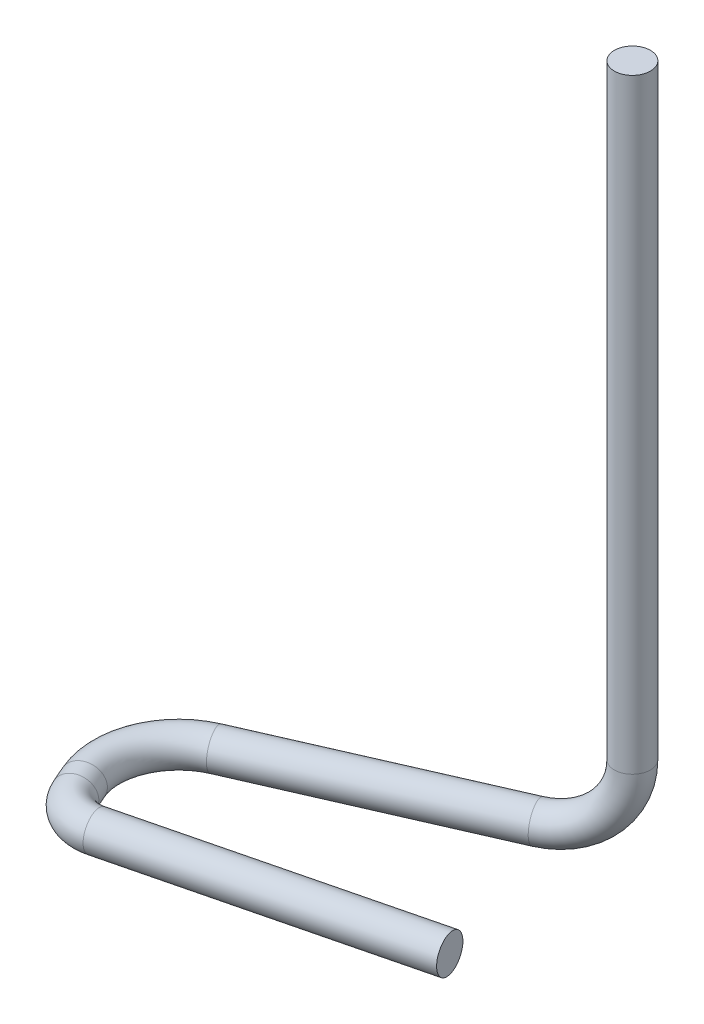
ISO-10303-21;
HEADER;
FILE_DESCRIPTION(('STEP AP214'),'2;1');
FILE_NAME('part.step','',(''),(''),'','','');
FILE_SCHEMA(('AUTOMOTIVE_DESIGN { 1 0 10303 214 1 1 1 1 }'));
ENDSEC;
DATA;
#1=APPLICATION_CONTEXT('core data for automotive mechanical design processes');
#2=APPLICATION_PROTOCOL_DEFINITION('international standard','automotive_design',2000,#1);
#3=PRODUCT_CONTEXT('',#1,'mechanical');
#4=PRODUCT('Part','Part','',(#3));
#5=PRODUCT_RELATED_PRODUCT_CATEGORY('part','',(#4));
#6=PRODUCT_DEFINITION_FORMATION('','',#4);
#7=PRODUCT_DEFINITION_CONTEXT('part definition',#1,'design');
#8=PRODUCT_DEFINITION('design','',#6,#7);
#9=PRODUCT_DEFINITION_SHAPE('','',#8);
#10=(LENGTH_UNIT() NAMED_UNIT(*) SI_UNIT(.MILLI.,.METRE.));
#11=(NAMED_UNIT(*) PLANE_ANGLE_UNIT() SI_UNIT($,.RADIAN.));
#12=(NAMED_UNIT(*) SI_UNIT($,.STERADIAN.) SOLID_ANGLE_UNIT());
#13=UNCERTAINTY_MEASURE_WITH_UNIT(LENGTH_MEASURE(1.E-05),#10,'distance_accuracy_value','');
#14=(GEOMETRIC_REPRESENTATION_CONTEXT(3) GLOBAL_UNCERTAINTY_ASSIGNED_CONTEXT((#13)) GLOBAL_UNIT_ASSIGNED_CONTEXT((#10,
#11,#12)) REPRESENTATION_CONTEXT('',''));
#15=CARTESIAN_POINT('',(0.,0.,0.));
#16=DIRECTION('',(0.,0.,1.));
#17=DIRECTION('',(1.,0.,0.));
#18=AXIS2_PLACEMENT_3D('',#15,#16,#17);
#19=CARTESIAN_POINT('',(0.66040203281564,-3.39999999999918,12.6905504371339));
#20=DIRECTION('',(0.970640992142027,0.,-0.240532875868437));
#21=DIRECTION('',(-0.240532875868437,0.,-0.970640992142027));
#22=AXIS2_PLACEMENT_3D('',#19,#20,#21);
#23=CYLINDRICAL_SURFACE('',#22,0.25);
#24=CARTESIAN_POINT('',(0.66040203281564,-3.39999999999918,12.6905504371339));
#25=DIRECTION('',(0.970640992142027,0.,-0.240532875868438));
#26=DIRECTION('',(0.22036018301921,-0.400873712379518,0.88923655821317));
#27=AXIS2_PLACEMENT_3D('',#24,#25,#26);
#28=CIRCLE('',#27,0.25);
#29=CARTESIAN_POINT('',(0.720535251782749,-3.39999999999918,12.9332106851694));
#30=VERTEX_POINT('',#29);
#31=EDGE_CURVE('E30',#30,#30,#28,.T.);
#32=ORIENTED_EDGE('',*,*,#31,.T.);
#33=EDGE_LOOP('',(#32));
#34=FACE_BOUND('',#33,.T.);
#35=CARTESIAN_POINT('',(4.59218813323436,-3.39999999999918,11.7162212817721));
#36=DIRECTION('',(0.970640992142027,0.,-0.240532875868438));
#37=DIRECTION('',(0.22036018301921,-0.400873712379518,0.88923655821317));
#38=AXIS2_PLACEMENT_3D('',#35,#36,#37);
#39=CIRCLE('',#38,0.25);
#40=CARTESIAN_POINT('',(4.64727817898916,-3.50021842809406,11.9385304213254));
#41=VERTEX_POINT('',#40);
#42=EDGE_CURVE('E10',#41,#41,#39,.T.);
#43=ORIENTED_EDGE('',*,*,#42,.F.);
#44=EDGE_LOOP('',(#43));
#45=FACE_BOUND('',#44,.T.);
#46=ADVANCED_FACE('F24',(#34,#45),#23,.T.);
#47=CARTESIAN_POINT('',(0.540135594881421,-3.39999999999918,12.2052299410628));
#48=DIRECTION('',(0.,1.,0.));
#49=DIRECTION('',(0.,0.,1.));
#50=AXIS2_PLACEMENT_3D('',#47,#48,#49);
#51=TOROIDAL_SURFACE('',#50,0.500000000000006,0.25);
#52=CARTESIAN_POINT('',(0.0820689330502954,-3.39999999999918,12.4056667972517));
#53=DIRECTION('',(0.400873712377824,0.,0.91613332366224));
#54=DIRECTION('',(-0.839300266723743,-0.400873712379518,0.367253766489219));
#55=AXIS2_PLACEMENT_3D('',#52,#53,#54);
#56=CIRCLE('',#55,0.25);
#57=CARTESIAN_POINT('',(-0.146964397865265,-3.39999999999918,12.5058852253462));
#58=VERTEX_POINT('',#57);
#59=EDGE_CURVE('E34',#58,#58,#56,.T.);
#60=CARTESIAN_POINT('',(0.540135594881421,-3.39999999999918,12.2052299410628));
#61=DIRECTION('',(0.,1.,0.));
#62=DIRECTION('',(0.,0.,1.));
#63=AXIS2_PLACEMENT_3D('',#60,#61,#62);
#64=CIRCLE('',#63,0.750000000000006);
#65=EDGE_CURVE('',#58,#30,#64,.T.);
#66=ORIENTED_EDGE('',*,*,#59,.T.);
#67=ORIENTED_EDGE('',*,*,#31,.F.);
#68=ORIENTED_EDGE('',*,*,#65,.T.);
#69=ORIENTED_EDGE('',*,*,#65,.F.);
#70=EDGE_LOOP('',(#66,#68,#67,#69));
#71=FACE_BOUND('',#70,.T.);
#72=ADVANCED_FACE('F67',(#71),#51,.T.);
#73=CARTESIAN_POINT('',(-0.0109103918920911,-3.39999999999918,12.1931772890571));
#74=DIRECTION('',(0.400873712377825,0.,0.916133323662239));
#75=DIRECTION('',(0.916133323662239,0.,-0.400873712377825));
#76=AXIS2_PLACEMENT_3D('',#73,#74,#75);
#77=CYLINDRICAL_SURFACE('',#76,0.25);
#78=CARTESIAN_POINT('',(-0.0109103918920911,-3.39999999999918,12.1931772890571));
#79=DIRECTION('',(0.400873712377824,0.,0.91613332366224));
#80=DIRECTION('',(-0.839300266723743,-0.400873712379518,0.367253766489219));
#81=AXIS2_PLACEMENT_3D('',#78,#79,#80);
#82=CIRCLE('',#81,0.25);
#83=CARTESIAN_POINT('',(-0.239943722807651,-3.39999999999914,12.2933957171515));
#84=VERTEX_POINT('',#83);
#85=EDGE_CURVE('E38',#84,#84,#82,.T.);
#86=ORIENTED_EDGE('',*,*,#85,.T.);
#87=EDGE_LOOP('',(#86));
#88=FACE_BOUND('',#87,.T.);
#89=ORIENTED_EDGE('',*,*,#59,.F.);
#90=EDGE_LOOP('',(#89));
#91=FACE_BOUND('',#90,.T.);
#92=ADVANCED_FACE('F71',(#88,#91),#77,.T.);
#93=CARTESIAN_POINT('',(0.905222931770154,-3.39999999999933,11.7923035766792));
#94=DIRECTION('',(1.3910313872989E-13,1.,0.));
#95=DIRECTION('',(-1.,1.3910313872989E-13,0.));
#96=AXIS2_PLACEMENT_3D('',#93,#94,#95);
#97=TOROIDAL_SURFACE('',#96,1.00000000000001,0.25);
#98=CARTESIAN_POINT('',(0.504349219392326,-3.39999999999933,10.876170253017));
#99=DIRECTION('',(-0.916133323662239,1.50744065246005E-13,0.400873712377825));
#100=DIRECTION('',(-0.367253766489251,-0.400873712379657,-0.839300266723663));
#101=AXIS2_PLACEMENT_3D('',#98,#99,#100);
#102=CIRCLE('',#101,0.25);
#103=CARTESIAN_POINT('',(0.40413079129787,-3.39999999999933,10.6471369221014));
#104=VERTEX_POINT('',#103);
#105=EDGE_CURVE('E43',#104,#104,#102,.T.);
#106=CARTESIAN_POINT('',(0.905222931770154,-3.39999999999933,11.7923035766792));
#107=DIRECTION('',(1.3910313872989E-13,1.,0.));
#108=DIRECTION('',(-1.,1.3910313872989E-13,0.));
#109=AXIS2_PLACEMENT_3D('',#106,#107,#108);
#110=CIRCLE('',#109,1.25000000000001);
#111=EDGE_CURVE('',#104,#84,#110,.T.);
#112=ORIENTED_EDGE('',*,*,#105,.T.);
#113=ORIENTED_EDGE('',*,*,#85,.F.);
#114=ORIENTED_EDGE('',*,*,#111,.T.);
#115=ORIENTED_EDGE('',*,*,#111,.F.);
#116=EDGE_LOOP('',(#112,#114,#113,#115));
#117=FACE_BOUND('',#116,.T.);
#118=ADVANCED_FACE('F77',(#117),#97,.T.);
#119=CARTESIAN_POINT('',(3.61059388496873,-3.39999999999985,9.51696652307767));
#120=DIRECTION('',(-0.916133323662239,1.51825249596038E-13,0.400873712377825));
#121=DIRECTION('',(0.400873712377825,0.,0.916133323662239));
#122=AXIS2_PLACEMENT_3D('',#119,#120,#121);
#123=CYLINDRICAL_SURFACE('',#122,0.25);
#124=CARTESIAN_POINT('',(3.61059388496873,-3.39999999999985,9.51696652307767));
#125=DIRECTION('',(-0.916133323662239,1.50744065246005E-13,0.400873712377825));
#126=DIRECTION('',(-0.367253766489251,-0.400873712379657,-0.839300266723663));
#127=AXIS2_PLACEMENT_3D('',#124,#125,#126);
#128=CIRCLE('',#127,0.25);
#129=CARTESIAN_POINT('',(3.6105938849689,-3.64999999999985,9.51696652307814));
#130=VERTEX_POINT('',#129);
#131=EDGE_CURVE('E46',#130,#130,#128,.T.);
#132=ORIENTED_EDGE('',*,*,#131,.T.);
#133=EDGE_LOOP('',(#132));
#134=FACE_BOUND('',#133,.T.);
#135=ORIENTED_EDGE('',*,*,#105,.F.);
#136=EDGE_LOOP('',(#135));
#137=FACE_BOUND('',#136,.T.);
#138=ADVANCED_FACE('F84',(#134,#137),#123,.T.);
#139=CARTESIAN_POINT('',(3.61059388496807,-2.39999999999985,9.51696652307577));
#140=DIRECTION('',(-0.400873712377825,-1.99970248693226E-12,-0.916133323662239));
#141=DIRECTION('',(-0.916133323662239,0.,0.400873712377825));
#142=AXIS2_PLACEMENT_3D('',#139,#140,#141);
#143=TOROIDAL_SURFACE('',#142,1.,0.25);
#144=CARTESIAN_POINT('',(4.52672720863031,-2.39999999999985,9.11609281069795));
#145=DIRECTION('',(8.01586806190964E-13,-1.,1.83199189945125E-12));
#146=DIRECTION('',(0.,-1.83199189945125E-12,-1.));
#147=AXIS2_PLACEMENT_3D('',#144,#145,#146);
#148=CIRCLE('',#147,0.25);
#149=CARTESIAN_POINT('',(4.75576053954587,-2.39999999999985,9.01587438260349));
#150=VERTEX_POINT('',#149);
#151=EDGE_CURVE('E49',#150,#150,#148,.T.);
#152=CARTESIAN_POINT('',(3.61059388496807,-2.39999999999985,9.51696652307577));
#153=DIRECTION('',(-0.400873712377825,-1.99970248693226E-12,-0.916133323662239));
#154=DIRECTION('',(-0.916133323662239,0.,0.400873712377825));
#155=AXIS2_PLACEMENT_3D('',#152,#153,#154);
#156=CIRCLE('',#155,1.25);
#157=EDGE_CURVE('',#150,#130,#156,.T.);
#158=ORIENTED_EDGE('',*,*,#151,.T.);
#159=ORIENTED_EDGE('',*,*,#131,.F.);
#160=ORIENTED_EDGE('',*,*,#157,.T.);
#161=ORIENTED_EDGE('',*,*,#157,.F.);
#162=EDGE_LOOP('',(#158,#160,#159,#161));
#163=FACE_BOUND('',#162,.T.);
#164=ADVANCED_FACE('F88',(#163),#143,.T.);
#165=CARTESIAN_POINT('',(4.52672720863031,-2.39999999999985,9.11609281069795));
#166=DIRECTION('',(-8.01586806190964E-13,1.,-1.83199189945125E-12));
#167=DIRECTION('',(0.,1.83199189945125E-12,1.));
#168=AXIS2_PLACEMENT_3D('',#165,#166,#167);
#169=CYLINDRICAL_SURFACE('',#168,0.25);
#170=ORIENTED_EDGE('',*,*,#151,.F.);
#171=EDGE_LOOP('',(#170));
#172=FACE_BOUND('',#171,.T.);
#173=CARTESIAN_POINT('',(4.52672720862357,6.,9.11609281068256));
#174=DIRECTION('',(8.01586806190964E-13,-1.,1.83199189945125E-12));
#175=DIRECTION('',(0.,-1.83199189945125E-12,-1.));
#176=AXIS2_PLACEMENT_3D('',#173,#174,#175);
#177=CIRCLE('',#176,0.25);
#178=CARTESIAN_POINT('',(4.52672720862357,5.99999999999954,8.86609281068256));
#179=VERTEX_POINT('',#178);
#180=EDGE_CURVE('E52',#179,#179,#177,.T.);
#181=ORIENTED_EDGE('',*,*,#180,.T.);
#182=EDGE_LOOP('',(#181));
#183=FACE_BOUND('',#182,.T.);
#184=ADVANCED_FACE('F56',(#172,#183),#169,.T.);
#185=CARTESIAN_POINT('',(4.59218813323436,-3.39999999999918,11.7162212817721));
#186=DIRECTION('',(0.970640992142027,0.,-0.240532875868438));
#187=DIRECTION('',(0.22036018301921,-0.400873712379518,0.88923655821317));
#188=AXIS2_PLACEMENT_3D('',#185,#186,#187);
#189=PLANE('',#188);
#190=ORIENTED_EDGE('',*,*,#42,.T.);
#191=EDGE_LOOP('',(#190));
#192=FACE_BOUND('',#191,.T.);
#193=ADVANCED_FACE('F60',(#192),#189,.T.);
#194=CARTESIAN_POINT('',(4.52672720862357,6.,9.11609281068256));
#195=DIRECTION('',(8.01586806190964E-13,-1.,1.83199189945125E-12));
#196=DIRECTION('',(0.,-1.83199189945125E-12,-1.));
#197=AXIS2_PLACEMENT_3D('',#194,#195,#196);
#198=PLANE('',#197);
#199=ORIENTED_EDGE('',*,*,#180,.F.);
#200=EDGE_LOOP('',(#199));
#201=FACE_BOUND('',#200,.T.);
#202=ADVANCED_FACE('F58',(#201),#198,.F.);
#203=CLOSED_SHELL('',(#46,#72,#92,#118,#138,#164,#184,#193,#202));
#204=MANIFOLD_SOLID_BREP('B2',#203);
#205=ADVANCED_BREP_SHAPE_REPRESENTATION('',(#18,#204),#14);
#206=SHAPE_DEFINITION_REPRESENTATION(#9,#205);
ENDSEC;
END-ISO-10303-21;
